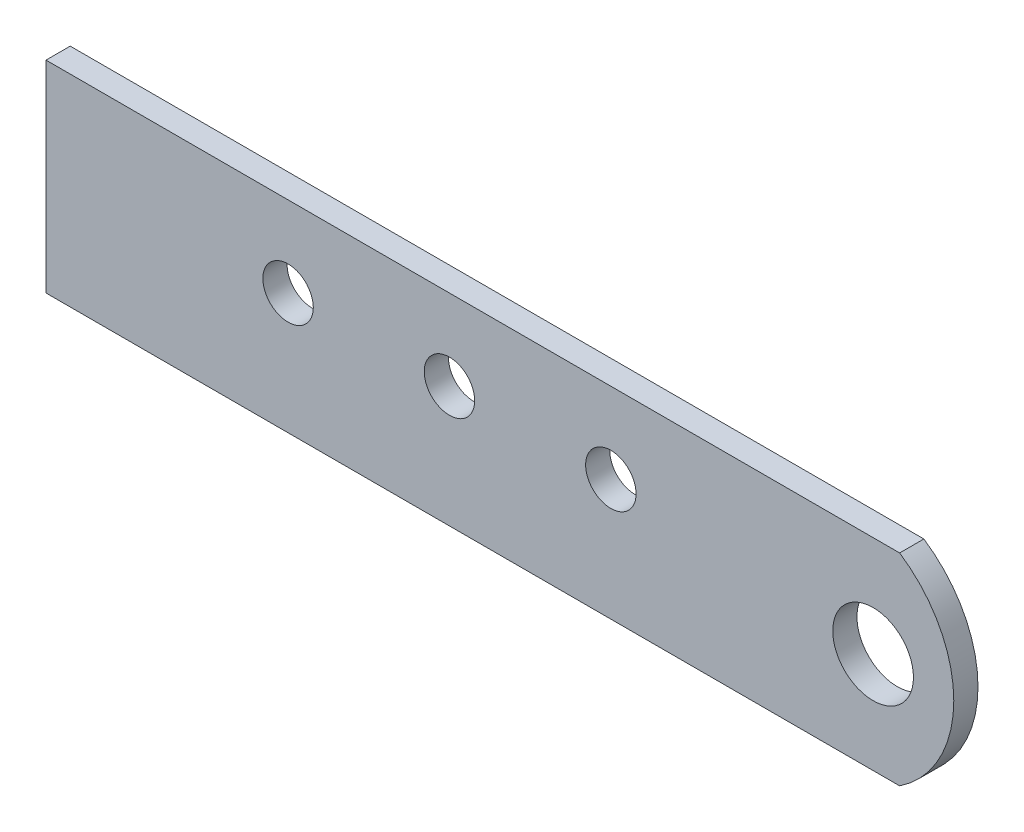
ISO-10303-21;
HEADER;
FILE_DESCRIPTION(('STEP AP214'),'2;1');
FILE_NAME('part.step','',(''),(''),'','','');
FILE_SCHEMA(('AUTOMOTIVE_DESIGN { 1 0 10303 214 1 1 1 1 }'));
ENDSEC;
DATA;
#1=APPLICATION_CONTEXT('core data for automotive mechanical design processes');
#2=APPLICATION_PROTOCOL_DEFINITION('international standard','automotive_design',2000,#1);
#3=PRODUCT_CONTEXT('',#1,'mechanical');
#4=PRODUCT('Part','Part','',(#3));
#5=PRODUCT_RELATED_PRODUCT_CATEGORY('part','',(#4));
#6=PRODUCT_DEFINITION_FORMATION('','',#4);
#7=PRODUCT_DEFINITION_CONTEXT('part definition',#1,'design');
#8=PRODUCT_DEFINITION('design','',#6,#7);
#9=PRODUCT_DEFINITION_SHAPE('','',#8);
#10=(LENGTH_UNIT() NAMED_UNIT(*) SI_UNIT(.MILLI.,.METRE.));
#11=(NAMED_UNIT(*) PLANE_ANGLE_UNIT() SI_UNIT($,.RADIAN.));
#12=(NAMED_UNIT(*) SI_UNIT($,.STERADIAN.) SOLID_ANGLE_UNIT());
#13=UNCERTAINTY_MEASURE_WITH_UNIT(LENGTH_MEASURE(1.E-05),#10,'distance_accuracy_value','');
#14=(GEOMETRIC_REPRESENTATION_CONTEXT(3) GLOBAL_UNCERTAINTY_ASSIGNED_CONTEXT((#13)) GLOBAL_UNIT_ASSIGNED_CONTEXT((#10,
#11,#12)) REPRESENTATION_CONTEXT('',''));
#15=CARTESIAN_POINT('',(0.,0.,0.));
#16=DIRECTION('',(0.,0.,1.));
#17=DIRECTION('',(1.,0.,0.));
#18=AXIS2_PLACEMENT_3D('',#15,#16,#17);
#19=CARTESIAN_POINT('',(390.000000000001,-49.9999999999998,12.));
#20=DIRECTION('',(0.,0.,1.));
#21=DIRECTION('',(1.,0.,0.));
#22=AXIS2_PLACEMENT_3D('',#19,#20,#21);
#23=PLANE('',#22);
#24=CARTESIAN_POINT('',(200.,-39.9999999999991,12.));
#25=DIRECTION('',(0.,0.,1.));
#26=DIRECTION('',(1.,0.,0.));
#27=AXIS2_PLACEMENT_3D('',#24,#25,#26);
#28=CIRCLE('',#27,12.5);
#29=CARTESIAN_POINT('',(212.5,-39.9999999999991,12.));
#30=VERTEX_POINT('',#29);
#31=EDGE_CURVE('E130',#30,#30,#28,.T.);
#32=ORIENTED_EDGE('',*,*,#31,.F.);
#33=EDGE_LOOP('',(#32));
#34=FACE_BOUND('',#33,.T.);
#35=CARTESIAN_POINT('',(410.000000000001,-49.9999999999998,12.));
#36=DIRECTION('',(0.,0.,1.));
#37=DIRECTION('',(1.,0.,0.));
#38=AXIS2_PLACEMENT_3D('',#35,#36,#37);
#39=CIRCLE('',#38,20.);
#40=CARTESIAN_POINT('',(430.000000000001,-49.9999999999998,12.));
#41=VERTEX_POINT('',#40);
#42=EDGE_CURVE('E92',#41,#41,#39,.T.);
#43=ORIENTED_EDGE('',*,*,#42,.F.);
#44=EDGE_LOOP('',(#43));
#45=FACE_BOUND('',#44,.T.);
#46=DIRECTION('',(0.,-1.,0.));
#47=VECTOR('',#46,1.);
#48=CARTESIAN_POINT('',(0.,0.,12.));
#49=LINE('',#48,#47);
#50=CARTESIAN_POINT('',(0.,0.,12.));
#51=VERTEX_POINT('',#50);
#52=CARTESIAN_POINT('',(0.,-99.9999999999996,12.));
#53=VERTEX_POINT('',#52);
#54=EDGE_CURVE('E102',#51,#53,#49,.T.);
#55=ORIENTED_EDGE('',*,*,#54,.T.);
#56=DIRECTION('',(1.,0.,0.));
#57=VECTOR('',#56,1.);
#58=CARTESIAN_POINT('',(0.,-99.9999999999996,12.));
#59=LINE('',#58,#57);
#60=CARTESIAN_POINT('',(423.166247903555,-99.9999999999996,12.));
#61=VERTEX_POINT('',#60);
#62=EDGE_CURVE('E87',#53,#61,#59,.T.);
#63=ORIENTED_EDGE('',*,*,#62,.T.);
#64=CARTESIAN_POINT('',(390.000000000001,-49.9999999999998,12.));
#65=DIRECTION('',(0.,0.,1.));
#66=DIRECTION('',(1.,0.,0.));
#67=AXIS2_PLACEMENT_3D('',#64,#65,#66);
#68=CIRCLE('',#67,60.);
#69=CARTESIAN_POINT('',(423.166247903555,0.,12.));
#70=VERTEX_POINT('',#69);
#71=EDGE_CURVE('E53',#61,#70,#68,.T.);
#72=ORIENTED_EDGE('',*,*,#71,.T.);
#73=DIRECTION('',(-1.,0.,0.));
#74=VECTOR('',#73,1.);
#75=CARTESIAN_POINT('',(0.,0.,12.));
#76=LINE('',#75,#74);
#77=EDGE_CURVE('E48',#70,#51,#76,.T.);
#78=ORIENTED_EDGE('',*,*,#77,.T.);
#79=EDGE_LOOP('',(#55,#63,#72,#78));
#80=FACE_BOUND('',#79,.T.);
#81=CARTESIAN_POINT('',(120.,-40.,12.));
#82=DIRECTION('',(0.,0.,1.));
#83=DIRECTION('',(1.,0.,0.));
#84=AXIS2_PLACEMENT_3D('',#81,#82,#83);
#85=CIRCLE('',#84,12.5);
#86=CARTESIAN_POINT('',(132.5,-40.,12.));
#87=VERTEX_POINT('',#86);
#88=EDGE_CURVE('E121',#87,#87,#85,.T.);
#89=ORIENTED_EDGE('',*,*,#88,.F.);
#90=EDGE_LOOP('',(#89));
#91=FACE_BOUND('',#90,.T.);
#92=CARTESIAN_POINT('',(280.000000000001,-39.9999999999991,12.));
#93=DIRECTION('',(0.,0.,1.));
#94=DIRECTION('',(1.,0.,0.));
#95=AXIS2_PLACEMENT_3D('',#92,#93,#94);
#96=CIRCLE('',#95,12.5);
#97=CARTESIAN_POINT('',(292.500000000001,-39.9999999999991,12.));
#98=VERTEX_POINT('',#97);
#99=EDGE_CURVE('E124',#98,#98,#96,.T.);
#100=ORIENTED_EDGE('',*,*,#99,.F.);
#101=EDGE_LOOP('',(#100));
#102=FACE_BOUND('',#101,.T.);
#103=ADVANCED_FACE('F33',(#34,#45,#80,#91,#102),#23,.T.);
#104=CARTESIAN_POINT('',(390.000000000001,-49.9999999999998,0.));
#105=DIRECTION('',(0.,0.,1.));
#106=DIRECTION('',(1.,0.,0.));
#107=AXIS2_PLACEMENT_3D('',#104,#105,#106);
#108=PLANE('',#107);
#109=CARTESIAN_POINT('',(200.,-39.9999999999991,0.));
#110=DIRECTION('',(0.,0.,1.));
#111=DIRECTION('',(1.,0.,0.));
#112=AXIS2_PLACEMENT_3D('',#109,#110,#111);
#113=CIRCLE('',#112,12.5);
#114=CARTESIAN_POINT('',(212.5,-39.9999999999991,0.));
#115=VERTEX_POINT('',#114);
#116=EDGE_CURVE('E126',#115,#115,#113,.T.);
#117=ORIENTED_EDGE('',*,*,#116,.T.);
#118=EDGE_LOOP('',(#117));
#119=FACE_BOUND('',#118,.T.);
#120=CARTESIAN_POINT('',(410.000000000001,-49.9999999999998,0.));
#121=DIRECTION('',(0.,0.,1.));
#122=DIRECTION('',(1.,0.,0.));
#123=AXIS2_PLACEMENT_3D('',#120,#121,#122);
#124=CIRCLE('',#123,20.);
#125=CARTESIAN_POINT('',(430.000000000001,-49.9999999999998,0.));
#126=VERTEX_POINT('',#125);
#127=EDGE_CURVE('E95',#126,#126,#124,.T.);
#128=ORIENTED_EDGE('',*,*,#127,.T.);
#129=EDGE_LOOP('',(#128));
#130=FACE_BOUND('',#129,.T.);
#131=DIRECTION('',(0.,-1.,0.));
#132=VECTOR('',#131,1.);
#133=CARTESIAN_POINT('',(0.,0.,0.));
#134=LINE('',#133,#132);
#135=CARTESIAN_POINT('',(0.,0.,0.));
#136=VERTEX_POINT('',#135);
#137=CARTESIAN_POINT('',(0.,-99.9999999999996,0.));
#138=VERTEX_POINT('',#137);
#139=EDGE_CURVE('E79',#136,#138,#134,.T.);
#140=ORIENTED_EDGE('',*,*,#139,.F.);
#141=DIRECTION('',(-1.,0.,0.));
#142=VECTOR('',#141,1.);
#143=CARTESIAN_POINT('',(0.,0.,0.));
#144=LINE('',#143,#142);
#145=CARTESIAN_POINT('',(423.166247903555,0.,0.));
#146=VERTEX_POINT('',#145);
#147=EDGE_CURVE('E100',#146,#136,#144,.T.);
#148=ORIENTED_EDGE('',*,*,#147,.F.);
#149=CARTESIAN_POINT('',(390.000000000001,-49.9999999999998,0.));
#150=DIRECTION('',(0.,0.,1.));
#151=DIRECTION('',(1.,0.,0.));
#152=AXIS2_PLACEMENT_3D('',#149,#150,#151);
#153=CIRCLE('',#152,60.);
#154=CARTESIAN_POINT('',(423.166247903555,-99.9999999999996,0.));
#155=VERTEX_POINT('',#154);
#156=EDGE_CURVE('E80',#155,#146,#153,.T.);
#157=ORIENTED_EDGE('',*,*,#156,.F.);
#158=DIRECTION('',(1.,0.,0.));
#159=VECTOR('',#158,1.);
#160=CARTESIAN_POINT('',(0.,-99.9999999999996,0.));
#161=LINE('',#160,#159);
#162=EDGE_CURVE('E74',#138,#155,#161,.T.);
#163=ORIENTED_EDGE('',*,*,#162,.F.);
#164=EDGE_LOOP('',(#140,#148,#157,#163));
#165=FACE_BOUND('',#164,.T.);
#166=CARTESIAN_POINT('',(120.,-40.,0.));
#167=DIRECTION('',(0.,0.,1.));
#168=DIRECTION('',(1.,0.,0.));
#169=AXIS2_PLACEMENT_3D('',#166,#167,#168);
#170=CIRCLE('',#169,12.5);
#171=CARTESIAN_POINT('',(132.5,-40.,0.));
#172=VERTEX_POINT('',#171);
#173=EDGE_CURVE('E137',#172,#172,#170,.T.);
#174=ORIENTED_EDGE('',*,*,#173,.T.);
#175=EDGE_LOOP('',(#174));
#176=FACE_BOUND('',#175,.T.);
#177=CARTESIAN_POINT('',(280.000000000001,-39.9999999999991,0.));
#178=DIRECTION('',(0.,0.,1.));
#179=DIRECTION('',(1.,0.,0.));
#180=AXIS2_PLACEMENT_3D('',#177,#178,#179);
#181=CIRCLE('',#180,12.5);
#182=CARTESIAN_POINT('',(292.500000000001,-39.9999999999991,0.));
#183=VERTEX_POINT('',#182);
#184=EDGE_CURVE('E127',#183,#183,#181,.T.);
#185=ORIENTED_EDGE('',*,*,#184,.T.);
#186=EDGE_LOOP('',(#185));
#187=FACE_BOUND('',#186,.T.);
#188=ADVANCED_FACE('F75',(#119,#130,#165,#176,#187),#108,.F.);
#189=CARTESIAN_POINT('',(0.,0.,12.));
#190=DIRECTION('',(1.,0.,0.));
#191=DIRECTION('',(0.,1.,0.));
#192=AXIS2_PLACEMENT_3D('',#189,#190,#191);
#193=PLANE('',#192);
#194=ORIENTED_EDGE('',*,*,#139,.T.);
#195=DIRECTION('',(0.,0.,-1.));
#196=VECTOR('',#195,1.);
#197=CARTESIAN_POINT('',(0.,-99.9999999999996,12.));
#198=LINE('',#197,#196);
#199=EDGE_CURVE('E11',#53,#138,#198,.T.);
#200=ORIENTED_EDGE('',*,*,#199,.F.);
#201=ORIENTED_EDGE('',*,*,#54,.F.);
#202=DIRECTION('',(0.,0.,-1.));
#203=VECTOR('',#202,1.);
#204=CARTESIAN_POINT('',(0.,0.,12.));
#205=LINE('',#204,#203);
#206=EDGE_CURVE('E91',#51,#136,#205,.T.);
#207=ORIENTED_EDGE('',*,*,#206,.T.);
#208=EDGE_LOOP('',(#194,#200,#201,#207));
#209=FACE_BOUND('',#208,.T.);
#210=ADVANCED_FACE('F35',(#209),#193,.F.);
#211=CARTESIAN_POINT('',(0.,-99.9999999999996,12.));
#212=DIRECTION('',(0.,1.,0.));
#213=DIRECTION('',(0.,0.,1.));
#214=AXIS2_PLACEMENT_3D('',#211,#212,#213);
#215=PLANE('',#214);
#216=ORIENTED_EDGE('',*,*,#162,.T.);
#217=DIRECTION('',(0.,0.,-1.));
#218=VECTOR('',#217,1.);
#219=CARTESIAN_POINT('',(423.166247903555,-99.9999999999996,12.));
#220=LINE('',#219,#218);
#221=EDGE_CURVE('E41',#61,#155,#220,.T.);
#222=ORIENTED_EDGE('',*,*,#221,.F.);
#223=ORIENTED_EDGE('',*,*,#62,.F.);
#224=ORIENTED_EDGE('',*,*,#199,.T.);
#225=EDGE_LOOP('',(#216,#222,#223,#224));
#226=FACE_BOUND('',#225,.T.);
#227=ADVANCED_FACE('F86',(#226),#215,.F.);
#228=CARTESIAN_POINT('',(390.000000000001,-49.9999999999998,12.));
#229=DIRECTION('',(0.,0.,-1.));
#230=DIRECTION('',(-1.,0.,0.));
#231=AXIS2_PLACEMENT_3D('',#228,#229,#230);
#232=CYLINDRICAL_SURFACE('',#231,60.);
#233=ORIENTED_EDGE('',*,*,#156,.T.);
#234=DIRECTION('',(0.,0.,-1.));
#235=VECTOR('',#234,1.);
#236=CARTESIAN_POINT('',(423.166247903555,0.,12.));
#237=LINE('',#236,#235);
#238=EDGE_CURVE('E108',#70,#146,#237,.T.);
#239=ORIENTED_EDGE('',*,*,#238,.F.);
#240=ORIENTED_EDGE('',*,*,#71,.F.);
#241=ORIENTED_EDGE('',*,*,#221,.T.);
#242=EDGE_LOOP('',(#233,#239,#240,#241));
#243=FACE_BOUND('',#242,.T.);
#244=ADVANCED_FACE('F111',(#243),#232,.T.);
#245=CARTESIAN_POINT('',(0.,0.,12.));
#246=DIRECTION('',(0.,-1.,0.));
#247=DIRECTION('',(0.,0.,-1.));
#248=AXIS2_PLACEMENT_3D('',#245,#246,#247);
#249=PLANE('',#248);
#250=ORIENTED_EDGE('',*,*,#147,.T.);
#251=ORIENTED_EDGE('',*,*,#206,.F.);
#252=ORIENTED_EDGE('',*,*,#77,.F.);
#253=ORIENTED_EDGE('',*,*,#238,.T.);
#254=EDGE_LOOP('',(#250,#251,#252,#253));
#255=FACE_BOUND('',#254,.T.);
#256=ADVANCED_FACE('F113',(#255),#249,.F.);
#257=CARTESIAN_POINT('',(410.000000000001,-49.9999999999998,12.));
#258=DIRECTION('',(0.,0.,-1.));
#259=DIRECTION('',(-1.,0.,0.));
#260=AXIS2_PLACEMENT_3D('',#257,#258,#259);
#261=CYLINDRICAL_SURFACE('',#260,20.);
#262=ORIENTED_EDGE('',*,*,#42,.T.);
#263=EDGE_LOOP('',(#262));
#264=FACE_BOUND('',#263,.T.);
#265=ORIENTED_EDGE('',*,*,#127,.F.);
#266=EDGE_LOOP('',(#265));
#267=FACE_BOUND('',#266,.T.);
#268=ADVANCED_FACE('F144',(#264,#267),#261,.F.);
#269=CARTESIAN_POINT('',(120.,-40.,12.));
#270=DIRECTION('',(0.,0.,-1.));
#271=DIRECTION('',(-1.,0.,0.));
#272=AXIS2_PLACEMENT_3D('',#269,#270,#271);
#273=CYLINDRICAL_SURFACE('',#272,12.5);
#274=ORIENTED_EDGE('',*,*,#88,.T.);
#275=EDGE_LOOP('',(#274));
#276=FACE_BOUND('',#275,.T.);
#277=ORIENTED_EDGE('',*,*,#173,.F.);
#278=EDGE_LOOP('',(#277));
#279=FACE_BOUND('',#278,.T.);
#280=ADVANCED_FACE('F146',(#276,#279),#273,.F.);
#281=CARTESIAN_POINT('',(200.,-39.9999999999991,12.));
#282=DIRECTION('',(0.,0.,-1.));
#283=DIRECTION('',(-1.,0.,0.));
#284=AXIS2_PLACEMENT_3D('',#281,#282,#283);
#285=CYLINDRICAL_SURFACE('',#284,12.5);
#286=ORIENTED_EDGE('',*,*,#31,.T.);
#287=EDGE_LOOP('',(#286));
#288=FACE_BOUND('',#287,.T.);
#289=ORIENTED_EDGE('',*,*,#116,.F.);
#290=EDGE_LOOP('',(#289));
#291=FACE_BOUND('',#290,.T.);
#292=ADVANCED_FACE('F153',(#288,#291),#285,.F.);
#293=CARTESIAN_POINT('',(280.000000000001,-39.9999999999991,12.));
#294=DIRECTION('',(0.,0.,-1.));
#295=DIRECTION('',(-1.,0.,0.));
#296=AXIS2_PLACEMENT_3D('',#293,#294,#295);
#297=CYLINDRICAL_SURFACE('',#296,12.5);
#298=ORIENTED_EDGE('',*,*,#99,.T.);
#299=EDGE_LOOP('',(#298));
#300=FACE_BOUND('',#299,.T.);
#301=ORIENTED_EDGE('',*,*,#184,.F.);
#302=EDGE_LOOP('',(#301));
#303=FACE_BOUND('',#302,.T.);
#304=ADVANCED_FACE('F214',(#300,#303),#297,.F.);
#305=CLOSED_SHELL('',(#103,#188,#210,#227,#244,#256,#268,#280,#292,#304));
#306=MANIFOLD_SOLID_BREP('B2',#305);
#307=ADVANCED_BREP_SHAPE_REPRESENTATION('',(#18,#306),#14);
#308=SHAPE_DEFINITION_REPRESENTATION(#9,#307);
ENDSEC;
END-ISO-10303-21;
